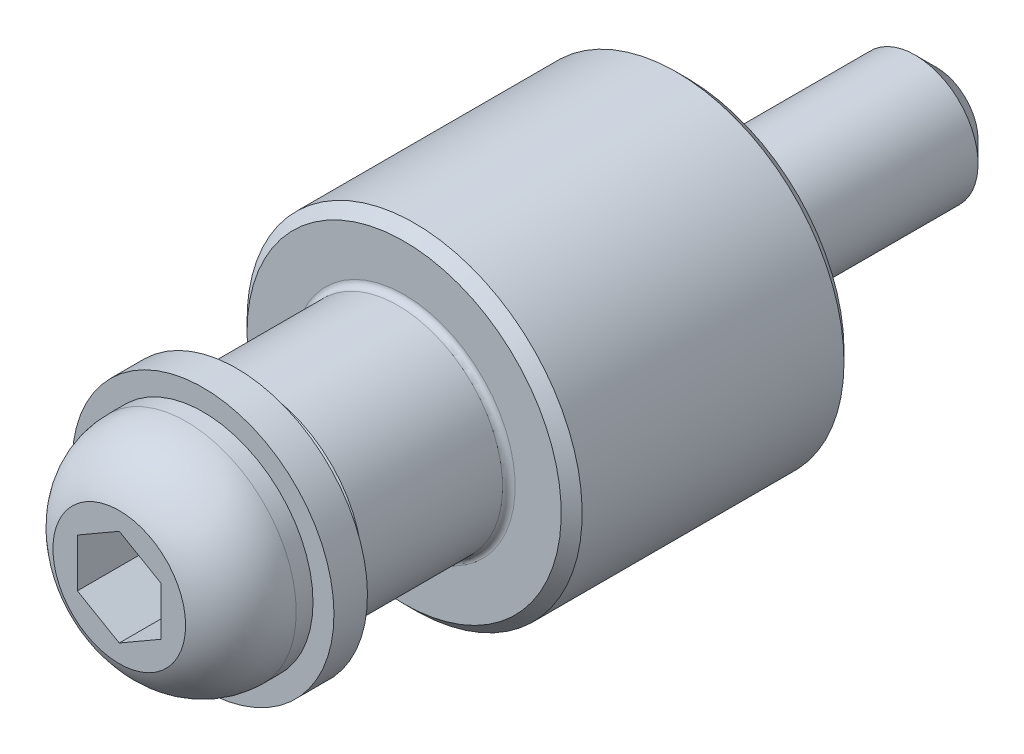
ISO-10303-21;
HEADER;
FILE_DESCRIPTION(('STEP AP214'),'2;1');
FILE_NAME('part.step','',(''),(''),'','','');
FILE_SCHEMA(('AUTOMOTIVE_DESIGN { 1 0 10303 214 1 1 1 1 }'));
ENDSEC;
DATA;
#1=APPLICATION_CONTEXT('core data for automotive mechanical design processes');
#2=APPLICATION_PROTOCOL_DEFINITION('international standard','automotive_design',2000,#1);
#3=PRODUCT_CONTEXT('',#1,'mechanical');
#4=PRODUCT('Part','Part','',(#3));
#5=PRODUCT_RELATED_PRODUCT_CATEGORY('part','',(#4));
#6=PRODUCT_DEFINITION_FORMATION('','',#4);
#7=PRODUCT_DEFINITION_CONTEXT('part definition',#1,'design');
#8=PRODUCT_DEFINITION('design','',#6,#7);
#9=PRODUCT_DEFINITION_SHAPE('','',#8);
#10=(LENGTH_UNIT() NAMED_UNIT(*) SI_UNIT(.MILLI.,.METRE.));
#11=(NAMED_UNIT(*) PLANE_ANGLE_UNIT() SI_UNIT($,.RADIAN.));
#12=(NAMED_UNIT(*) SI_UNIT($,.STERADIAN.) SOLID_ANGLE_UNIT());
#13=UNCERTAINTY_MEASURE_WITH_UNIT(LENGTH_MEASURE(1.E-05),#10,'distance_accuracy_value','');
#14=(GEOMETRIC_REPRESENTATION_CONTEXT(3) GLOBAL_UNCERTAINTY_ASSIGNED_CONTEXT((#13)) GLOBAL_UNIT_ASSIGNED_CONTEXT((#10,
#11,#12)) REPRESENTATION_CONTEXT('',''));
#15=CARTESIAN_POINT('',(0.,0.,0.));
#16=DIRECTION('',(0.,0.,1.));
#17=DIRECTION('',(1.,0.,0.));
#18=AXIS2_PLACEMENT_3D('',#15,#16,#17);
#19=CARTESIAN_POINT('',(2.,-1.15470053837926,24.1));
#20=DIRECTION('',(0.,0.,1.));
#21=DIRECTION('',(-0.5,-0.866025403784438,0.));
#22=AXIS2_PLACEMENT_3D('',#19,#20,#21);
#23=PLANE('',#22);
#24=DIRECTION('',(0.86602540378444,0.5,0.));
#25=VECTOR('',#24,1.);
#26=CARTESIAN_POINT('',(0.,-2.30940107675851,24.1));
#27=LINE('',#26,#25);
#28=CARTESIAN_POINT('',(0.,-2.30940107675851,24.1));
#29=VERTEX_POINT('',#28);
#30=CARTESIAN_POINT('',(2.,-1.15470053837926,24.1));
#31=VERTEX_POINT('',#30);
#32=EDGE_CURVE('E101',#29,#31,#27,.T.);
#33=ORIENTED_EDGE('',*,*,#32,.T.);
#34=DIRECTION('',(0.,1.,0.));
#35=VECTOR('',#34,1.);
#36=CARTESIAN_POINT('',(2.,-1.15470053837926,24.1));
#37=LINE('',#36,#35);
#38=CARTESIAN_POINT('',(2.,1.15470053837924,24.1));
#39=VERTEX_POINT('',#38);
#40=EDGE_CURVE('E104',#31,#39,#37,.T.);
#41=ORIENTED_EDGE('',*,*,#40,.T.);
#42=DIRECTION('',(-0.866025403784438,0.5,0.));
#43=VECTOR('',#42,1.);
#44=CARTESIAN_POINT('',(2.,1.15470053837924,24.1));
#45=LINE('',#44,#43);
#46=CARTESIAN_POINT('',(0.,2.30940107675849,24.1));
#47=VERTEX_POINT('',#46);
#48=EDGE_CURVE('E75',#39,#47,#45,.T.);
#49=ORIENTED_EDGE('',*,*,#48,.T.);
#50=DIRECTION('',(-0.86602540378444,-0.5,0.));
#51=VECTOR('',#50,1.);
#52=CARTESIAN_POINT('',(0.,2.30940107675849,24.1));
#53=LINE('',#52,#51);
#54=CARTESIAN_POINT('',(-2.,1.15470053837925,24.1));
#55=VERTEX_POINT('',#54);
#56=EDGE_CURVE('E107',#47,#55,#53,.T.);
#57=ORIENTED_EDGE('',*,*,#56,.T.);
#58=DIRECTION('',(0.,-1.,0.));
#59=VECTOR('',#58,1.);
#60=CARTESIAN_POINT('',(-2.,1.15470053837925,24.1));
#61=LINE('',#60,#59);
#62=CARTESIAN_POINT('',(-2.,-1.15470053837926,24.1));
#63=VERTEX_POINT('',#62);
#64=EDGE_CURVE('E110',#55,#63,#61,.T.);
#65=ORIENTED_EDGE('',*,*,#64,.T.);
#66=DIRECTION('',(0.866025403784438,-0.5,0.));
#67=VECTOR('',#66,1.);
#68=CARTESIAN_POINT('',(-2.,-1.15470053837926,24.1));
#69=LINE('',#68,#67);
#70=EDGE_CURVE('E113',#63,#29,#69,.T.);
#71=ORIENTED_EDGE('',*,*,#70,.T.);
#72=EDGE_LOOP('',(#33,#41,#49,#57,#65,#71));
#73=FACE_BOUND('',#72,.T.);
#74=ADVANCED_FACE('F14',(#73),#23,.T.);
#75=CARTESIAN_POINT('',(2.,1.15470053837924,24.1));
#76=DIRECTION('',(0.5,0.866025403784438,0.));
#77=DIRECTION('',(-0.866025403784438,0.5,0.));
#78=AXIS2_PLACEMENT_3D('',#75,#76,#77);
#79=PLANE('',#78);
#80=DIRECTION('',(-0.866025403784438,0.5,0.));
#81=VECTOR('',#80,1.);
#82=CARTESIAN_POINT('',(2.,1.15470053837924,27.1));
#83=LINE('',#82,#81);
#84=CARTESIAN_POINT('',(2.,1.15470053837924,27.1));
#85=VERTEX_POINT('',#84);
#86=CARTESIAN_POINT('',(0.,2.30940107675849,27.1));
#87=VERTEX_POINT('',#86);
#88=EDGE_CURVE('E72',#85,#87,#83,.T.);
#89=ORIENTED_EDGE('',*,*,#88,.T.);
#90=DIRECTION('',(0.,0.,1.));
#91=VECTOR('',#90,1.);
#92=CARTESIAN_POINT('',(0.,2.30940107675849,24.1));
#93=LINE('',#92,#91);
#94=EDGE_CURVE('E79',#47,#87,#93,.T.);
#95=ORIENTED_EDGE('',*,*,#94,.F.);
#96=ORIENTED_EDGE('',*,*,#48,.F.);
#97=DIRECTION('',(0.,0.,1.));
#98=VECTOR('',#97,1.);
#99=CARTESIAN_POINT('',(2.,1.15470053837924,24.1));
#100=LINE('',#99,#98);
#101=EDGE_CURVE('E68',#39,#85,#100,.T.);
#102=ORIENTED_EDGE('',*,*,#101,.T.);
#103=EDGE_LOOP('',(#89,#95,#96,#102));
#104=FACE_BOUND('',#103,.T.);
#105=ADVANCED_FACE('F70',(#104),#79,.F.);
#106=CARTESIAN_POINT('',(0.,2.30940107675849,24.1));
#107=DIRECTION('',(-0.5,0.86602540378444,0.));
#108=DIRECTION('',(-0.86602540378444,-0.5,0.));
#109=AXIS2_PLACEMENT_3D('',#106,#107,#108);
#110=PLANE('',#109);
#111=DIRECTION('',(-0.86602540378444,-0.5,0.));
#112=VECTOR('',#111,1.);
#113=CARTESIAN_POINT('',(0.,2.30940107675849,27.1));
#114=LINE('',#113,#112);
#115=CARTESIAN_POINT('',(-2.,1.15470053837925,27.1));
#116=VERTEX_POINT('',#115);
#117=EDGE_CURVE('E91',#87,#116,#114,.T.);
#118=ORIENTED_EDGE('',*,*,#117,.T.);
#119=DIRECTION('',(0.,0.,1.));
#120=VECTOR('',#119,1.);
#121=CARTESIAN_POINT('',(-2.,1.15470053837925,24.1));
#122=LINE('',#121,#120);
#123=EDGE_CURVE('E120',#55,#116,#122,.T.);
#124=ORIENTED_EDGE('',*,*,#123,.F.);
#125=ORIENTED_EDGE('',*,*,#56,.F.);
#126=ORIENTED_EDGE('',*,*,#94,.T.);
#127=EDGE_LOOP('',(#118,#124,#125,#126));
#128=FACE_BOUND('',#127,.T.);
#129=ADVANCED_FACE('F293',(#128),#110,.F.);
#130=CARTESIAN_POINT('',(-2.,1.15470053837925,24.1));
#131=DIRECTION('',(-1.,0.,0.));
#132=DIRECTION('',(0.,-1.,0.));
#133=AXIS2_PLACEMENT_3D('',#130,#131,#132);
#134=PLANE('',#133);
#135=DIRECTION('',(0.,-1.,0.));
#136=VECTOR('',#135,1.);
#137=CARTESIAN_POINT('',(-2.,1.15470053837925,27.1));
#138=LINE('',#137,#136);
#139=CARTESIAN_POINT('',(-2.,-1.15470053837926,27.1));
#140=VERTEX_POINT('',#139);
#141=EDGE_CURVE('E93',#116,#140,#138,.T.);
#142=ORIENTED_EDGE('',*,*,#141,.T.);
#143=DIRECTION('',(0.,0.,1.));
#144=VECTOR('',#143,1.);
#145=CARTESIAN_POINT('',(-2.,-1.15470053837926,24.1));
#146=LINE('',#145,#144);
#147=EDGE_CURVE('E118',#63,#140,#146,.T.);
#148=ORIENTED_EDGE('',*,*,#147,.F.);
#149=ORIENTED_EDGE('',*,*,#64,.F.);
#150=ORIENTED_EDGE('',*,*,#123,.T.);
#151=EDGE_LOOP('',(#142,#148,#149,#150));
#152=FACE_BOUND('',#151,.T.);
#153=ADVANCED_FACE('F290',(#152),#134,.F.);
#154=CARTESIAN_POINT('',(-2.,-1.15470053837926,24.1));
#155=DIRECTION('',(-0.5,-0.866025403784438,0.));
#156=DIRECTION('',(0.866025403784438,-0.5,0.));
#157=AXIS2_PLACEMENT_3D('',#154,#155,#156);
#158=PLANE('',#157);
#159=DIRECTION('',(0.866025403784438,-0.5,0.));
#160=VECTOR('',#159,1.);
#161=CARTESIAN_POINT('',(-2.,-1.15470053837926,27.1));
#162=LINE('',#161,#160);
#163=CARTESIAN_POINT('',(0.,-2.30940107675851,27.1));
#164=VERTEX_POINT('',#163);
#165=EDGE_CURVE('E99',#140,#164,#162,.T.);
#166=ORIENTED_EDGE('',*,*,#165,.T.);
#167=DIRECTION('',(0.,0.,1.));
#168=VECTOR('',#167,1.);
#169=CARTESIAN_POINT('',(0.,-2.30940107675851,24.1));
#170=LINE('',#169,#168);
#171=EDGE_CURVE('E36',#29,#164,#170,.T.);
#172=ORIENTED_EDGE('',*,*,#171,.F.);
#173=ORIENTED_EDGE('',*,*,#70,.F.);
#174=ORIENTED_EDGE('',*,*,#147,.T.);
#175=EDGE_LOOP('',(#166,#172,#173,#174));
#176=FACE_BOUND('',#175,.T.);
#177=ADVANCED_FACE('F286',(#176),#158,.F.);
#178=CARTESIAN_POINT('',(0.,-2.30940107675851,24.1));
#179=DIRECTION('',(0.5,-0.86602540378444,0.));
#180=DIRECTION('',(0.86602540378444,0.5,0.));
#181=AXIS2_PLACEMENT_3D('',#178,#179,#180);
#182=PLANE('',#181);
#183=DIRECTION('',(0.86602540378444,0.5,0.));
#184=VECTOR('',#183,1.);
#185=CARTESIAN_POINT('',(0.,-2.30940107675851,27.1));
#186=LINE('',#185,#184);
#187=CARTESIAN_POINT('',(2.,-1.15470053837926,27.1));
#188=VERTEX_POINT('',#187);
#189=EDGE_CURVE('E29',#164,#188,#186,.T.);
#190=ORIENTED_EDGE('',*,*,#189,.T.);
#191=DIRECTION('',(0.,0.,1.));
#192=VECTOR('',#191,1.);
#193=CARTESIAN_POINT('',(2.,-1.15470053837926,24.1));
#194=LINE('',#193,#192);
#195=EDGE_CURVE('E80',#31,#188,#194,.T.);
#196=ORIENTED_EDGE('',*,*,#195,.F.);
#197=ORIENTED_EDGE('',*,*,#32,.F.);
#198=ORIENTED_EDGE('',*,*,#171,.T.);
#199=EDGE_LOOP('',(#190,#196,#197,#198));
#200=FACE_BOUND('',#199,.T.);
#201=ADVANCED_FACE('F289',(#200),#182,.F.);
#202=CARTESIAN_POINT('',(2.,-1.15470053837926,24.1));
#203=DIRECTION('',(1.,0.,0.));
#204=DIRECTION('',(0.,1.,0.));
#205=AXIS2_PLACEMENT_3D('',#202,#203,#204);
#206=PLANE('',#205);
#207=DIRECTION('',(0.,1.,0.));
#208=VECTOR('',#207,1.);
#209=CARTESIAN_POINT('',(2.,-1.15470053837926,27.1));
#210=LINE('',#209,#208);
#211=EDGE_CURVE('E83',#188,#85,#210,.T.);
#212=ORIENTED_EDGE('',*,*,#211,.T.);
#213=ORIENTED_EDGE('',*,*,#101,.F.);
#214=ORIENTED_EDGE('',*,*,#40,.F.);
#215=ORIENTED_EDGE('',*,*,#195,.T.);
#216=EDGE_LOOP('',(#212,#213,#214,#215));
#217=FACE_BOUND('',#216,.T.);
#218=ADVANCED_FACE('F84',(#217),#206,.F.);
#219=CARTESIAN_POINT('',(0.,0.,27.1));
#220=DIRECTION('',(0.,0.,-1.));
#221=DIRECTION('',(0.5,0.866025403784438,0.));
#222=AXIS2_PLACEMENT_3D('',#219,#220,#221);
#223=PLANE('',#222);
#224=ORIENTED_EDGE('',*,*,#211,.F.);
#225=ORIENTED_EDGE('',*,*,#189,.F.);
#226=ORIENTED_EDGE('',*,*,#165,.F.);
#227=ORIENTED_EDGE('',*,*,#141,.F.);
#228=ORIENTED_EDGE('',*,*,#117,.F.);
#229=ORIENTED_EDGE('',*,*,#88,.F.);
#230=EDGE_LOOP('',(#224,#225,#226,#227,#228,#229));
#231=FACE_BOUND('',#230,.T.);
#232=CARTESIAN_POINT('',(0.,0.,27.1));
#233=DIRECTION('',(0.,0.,1.));
#234=DIRECTION('',(-0.5,-0.866025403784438,0.));
#235=AXIS2_PLACEMENT_3D('',#232,#233,#234);
#236=CIRCLE('',#235,3.16774468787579);
#237=CARTESIAN_POINT('',(-1.58387234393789,-2.74334737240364,27.1));
#238=VERTEX_POINT('',#237);
#239=EDGE_CURVE('E126',#238,#238,#236,.T.);
#240=ORIENTED_EDGE('',*,*,#239,.T.);
#241=EDGE_LOOP('',(#240));
#242=FACE_BOUND('',#241,.T.);
#243=ADVANCED_FACE('F87',(#231,#242),#223,.F.);
#244=CARTESIAN_POINT('',(0.,0.,23.9));
#245=DIRECTION('',(0.,0.,1.));
#246=DIRECTION('',(-0.5,-0.866025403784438,0.));
#247=AXIS2_PLACEMENT_3D('',#244,#245,#246);
#248=DEGENERATE_TOROIDAL_SURFACE('',#247,1.75,3.5,.T.);
#249=ORIENTED_EDGE('',*,*,#239,.F.);
#250=EDGE_LOOP('',(#249));
#251=FACE_BOUND('',#250,.T.);
#252=CARTESIAN_POINT('',(0.,0.,23.9));
#253=DIRECTION('',(0.,0.,1.));
#254=DIRECTION('',(-0.5,-0.866025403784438,0.));
#255=AXIS2_PLACEMENT_3D('',#252,#253,#254);
#256=CIRCLE('',#255,5.25);
#257=CARTESIAN_POINT('',(-2.625,-4.5466333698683,23.9));
#258=VERTEX_POINT('',#257);
#259=EDGE_CURVE('E129',#258,#258,#256,.T.);
#260=ORIENTED_EDGE('',*,*,#259,.T.);
#261=EDGE_LOOP('',(#260));
#262=FACE_BOUND('',#261,.T.);
#263=ADVANCED_FACE('F169',(#251,#262),#248,.T.);
#264=CARTESIAN_POINT('',(0.,0.,27.1));
#265=DIRECTION('',(0.,0.,1.));
#266=DIRECTION('',(-0.5,-0.866025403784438,0.));
#267=AXIS2_PLACEMENT_3D('',#264,#265,#266);
#268=CYLINDRICAL_SURFACE('',#267,5.25);
#269=ORIENTED_EDGE('',*,*,#259,.F.);
#270=EDGE_LOOP('',(#269));
#271=FACE_BOUND('',#270,.T.);
#272=CARTESIAN_POINT('',(0.,0.,23.1));
#273=DIRECTION('',(0.,0.,1.));
#274=DIRECTION('',(-0.5,-0.866025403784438,0.));
#275=AXIS2_PLACEMENT_3D('',#272,#273,#274);
#276=CIRCLE('',#275,5.25);
#277=CARTESIAN_POINT('',(-2.625,-4.5466333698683,23.1));
#278=VERTEX_POINT('',#277);
#279=EDGE_CURVE('E132',#278,#278,#276,.T.);
#280=ORIENTED_EDGE('',*,*,#279,.T.);
#281=EDGE_LOOP('',(#280));
#282=FACE_BOUND('',#281,.T.);
#283=ADVANCED_FACE('F158',(#271,#282),#268,.T.);
#284=CARTESIAN_POINT('',(0.,0.,27.1));
#285=DIRECTION('',(0.,0.,1.));
#286=DIRECTION('',(-0.5,-0.866025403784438,0.));
#287=AXIS2_PLACEMENT_3D('',#284,#285,#286);
#288=CYLINDRICAL_SURFACE('',#287,3.);
#289=CARTESIAN_POINT('',(0.,0.,-10.9));
#290=DIRECTION('',(0.,0.,-1.));
#291=DIRECTION('',(0.,1.,0.));
#292=AXIS2_PLACEMENT_3D('',#289,#290,#291);
#293=CIRCLE('',#292,3.);
#294=CARTESIAN_POINT('',(0.,2.99999999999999,-10.9));
#295=VERTEX_POINT('',#294);
#296=EDGE_CURVE('E9',#295,#295,#293,.F.);
#297=ORIENTED_EDGE('',*,*,#296,.T.);
#298=EDGE_LOOP('',(#297));
#299=FACE_BOUND('',#298,.T.);
#300=CARTESIAN_POINT('',(0.,0.,0.));
#301=DIRECTION('',(0.,0.,-1.));
#302=DIRECTION('',(-0.866025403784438,0.5,0.));
#303=AXIS2_PLACEMENT_3D('',#300,#301,#302);
#304=CIRCLE('',#303,3.);
#305=CARTESIAN_POINT('',(-2.59807621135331,1.5,0.));
#306=VERTEX_POINT('',#305);
#307=EDGE_CURVE('E135',#306,#306,#304,.T.);
#308=ORIENTED_EDGE('',*,*,#307,.T.);
#309=EDGE_LOOP('',(#308));
#310=FACE_BOUND('',#309,.T.);
#311=ADVANCED_FACE('F155',(#299,#310),#288,.T.);
#312=CARTESIAN_POINT('',(0.,0.,23.1));
#313=DIRECTION('',(0.,0.,1.));
#314=DIRECTION('',(-0.5,-0.866025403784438,0.));
#315=AXIS2_PLACEMENT_3D('',#312,#313,#314);
#316=CIRCLE('',#315,3.);
#317=CARTESIAN_POINT('',(-1.5,-2.59807621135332,23.1));
#318=VERTEX_POINT('',#317);
#319=EDGE_CURVE('E117',#318,#318,#316,.T.);
#320=ORIENTED_EDGE('',*,*,#319,.F.);
#321=EDGE_LOOP('',(#320));
#322=FACE_BOUND('',#321,.T.);
#323=CARTESIAN_POINT('',(0.,0.,21.));
#324=DIRECTION('',(0.,0.,-1.));
#325=DIRECTION('',(-0.866025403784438,0.5,0.));
#326=AXIS2_PLACEMENT_3D('',#323,#324,#325);
#327=CIRCLE('',#326,3.);
#328=CARTESIAN_POINT('',(-2.59807621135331,1.5,21.));
#329=VERTEX_POINT('',#328);
#330=EDGE_CURVE('E138',#329,#329,#327,.T.);
#331=ORIENTED_EDGE('',*,*,#330,.F.);
#332=EDGE_LOOP('',(#331));
#333=FACE_BOUND('',#332,.T.);
#334=ADVANCED_FACE('F157',(#322,#333),#288,.T.);
#335=CARTESIAN_POINT('',(1.5,2.59807621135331,23.1));
#336=DIRECTION('',(0.,0.,1.));
#337=DIRECTION('',(-0.5,-0.866025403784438,0.));
#338=AXIS2_PLACEMENT_3D('',#335,#336,#337);
#339=PLANE('',#338);
#340=CARTESIAN_POINT('',(0.,0.,23.1));
#341=DIRECTION('',(0.,0.,1.));
#342=DIRECTION('',(0.5,0.866025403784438,0.));
#343=AXIS2_PLACEMENT_3D('',#340,#341,#342);
#344=CIRCLE('',#343,3.2);
#345=CARTESIAN_POINT('',(1.6,2.7712812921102,23.1));
#346=VERTEX_POINT('',#345);
#347=EDGE_CURVE('E136',#346,#346,#344,.F.);
#348=ORIENTED_EDGE('',*,*,#347,.T.);
#349=EDGE_LOOP('',(#348));
#350=FACE_BOUND('',#349,.T.);
#351=ORIENTED_EDGE('',*,*,#319,.T.);
#352=EDGE_LOOP('',(#351));
#353=FACE_BOUND('',#352,.T.);
#354=ADVANCED_FACE('F166',(#350,#353),#339,.F.);
#355=CARTESIAN_POINT('',(0.,0.,23.1));
#356=DIRECTION('',(0.,0.,-1.));
#357=DIRECTION('',(-0.866025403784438,0.5,0.));
#358=AXIS2_PLACEMENT_3D('',#355,#356,#357);
#359=CYLINDRICAL_SURFACE('',#358,6.25);
#360=CARTESIAN_POINT('',(0.,0.,23.1));
#361=DIRECTION('',(0.,0.,1.));
#362=DIRECTION('',(0.866025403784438,-0.5,0.));
#363=AXIS2_PLACEMENT_3D('',#360,#361,#362);
#364=CIRCLE('',#363,6.25);
#365=CARTESIAN_POINT('',(5.41265877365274,-3.125,23.1));
#366=VERTEX_POINT('',#365);
#367=EDGE_CURVE('E256',#366,#366,#364,.T.);
#368=ORIENTED_EDGE('',*,*,#367,.F.);
#369=EDGE_LOOP('',(#368));
#370=FACE_BOUND('',#369,.T.);
#371=CARTESIAN_POINT('',(0.,0.,21.5));
#372=DIRECTION('',(0.,0.,1.));
#373=DIRECTION('',(0.866025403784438,-0.5,0.));
#374=AXIS2_PLACEMENT_3D('',#371,#372,#373);
#375=CIRCLE('',#374,6.25);
#376=CARTESIAN_POINT('',(5.41265877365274,-3.125,21.5));
#377=VERTEX_POINT('',#376);
#378=EDGE_CURVE('E253',#377,#377,#375,.T.);
#379=ORIENTED_EDGE('',*,*,#378,.T.);
#380=EDGE_LOOP('',(#379));
#381=FACE_BOUND('',#380,.T.);
#382=ADVANCED_FACE('F262',(#370,#381),#359,.T.);
#383=CARTESIAN_POINT('',(0.,0.,23.1));
#384=DIRECTION('',(0.,0.,1.));
#385=DIRECTION('',(0.866025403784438,-0.5,0.));
#386=AXIS2_PLACEMENT_3D('',#383,#384,#385);
#387=PLANE('',#386);
#388=ORIENTED_EDGE('',*,*,#367,.T.);
#389=EDGE_LOOP('',(#388));
#390=FACE_BOUND('',#389,.T.);
#391=ORIENTED_EDGE('',*,*,#279,.F.);
#392=EDGE_LOOP('',(#391));
#393=FACE_BOUND('',#392,.T.);
#394=ADVANCED_FACE('F172',(#390,#393),#387,.T.);
#395=CARTESIAN_POINT('',(0.,0.,21.5));
#396=DIRECTION('',(0.,0.,1.));
#397=DIRECTION('',(0.866025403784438,-0.5,0.));
#398=AXIS2_PLACEMENT_3D('',#395,#396,#397);
#399=PLANE('',#398);
#400=ORIENTED_EDGE('',*,*,#378,.F.);
#401=EDGE_LOOP('',(#400));
#402=FACE_BOUND('',#401,.T.);
#403=CARTESIAN_POINT('',(0.,0.,21.5));
#404=DIRECTION('',(0.,0.,1.));
#405=DIRECTION('',(0.866025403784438,-0.5,0.));
#406=AXIS2_PLACEMENT_3D('',#403,#404,#405);
#407=CIRCLE('',#406,3.2);
#408=CARTESIAN_POINT('',(2.7712812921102,-1.6,21.5));
#409=VERTEX_POINT('',#408);
#410=EDGE_CURVE('E250',#409,#409,#407,.T.);
#411=ORIENTED_EDGE('',*,*,#410,.T.);
#412=EDGE_LOOP('',(#411));
#413=FACE_BOUND('',#412,.T.);
#414=ADVANCED_FACE('F266',(#402,#413),#399,.F.);
#415=CARTESIAN_POINT('',(0.,0.,23.1));
#416=DIRECTION('',(0.,0.,-1.));
#417=DIRECTION('',(-0.866025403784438,0.5,0.));
#418=AXIS2_PLACEMENT_3D('',#415,#416,#417);
#419=CYLINDRICAL_SURFACE('',#418,3.2);
#420=ORIENTED_EDGE('',*,*,#347,.F.);
#421=EDGE_LOOP('',(#420));
#422=FACE_BOUND('',#421,.T.);
#423=ORIENTED_EDGE('',*,*,#410,.F.);
#424=EDGE_LOOP('',(#423));
#425=FACE_BOUND('',#424,.T.);
#426=ADVANCED_FACE('F153',(#422,#425),#419,.F.);
#427=CARTESIAN_POINT('',(0.,0.,13.8));
#428=DIRECTION('',(0.,0.,1.));
#429=DIRECTION('',(0.866025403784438,-0.5,0.));
#430=AXIS2_PLACEMENT_3D('',#427,#428,#429);
#431=TOROIDAL_SURFACE('',#430,5.3,0.3);
#432=CARTESIAN_POINT('',(0.,0.,13.8));
#433=DIRECTION('',(0.,0.,1.));
#434=DIRECTION('',(0.866025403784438,-0.5,0.));
#435=AXIS2_PLACEMENT_3D('',#432,#433,#434);
#436=CIRCLE('',#435,5.);
#437=CARTESIAN_POINT('',(4.33012701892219,-2.5,13.8));
#438=VERTEX_POINT('',#437);
#439=EDGE_CURVE('E232',#438,#438,#436,.T.);
#440=ORIENTED_EDGE('',*,*,#439,.F.);
#441=EDGE_LOOP('',(#440));
#442=FACE_BOUND('',#441,.T.);
#443=CARTESIAN_POINT('',(0.,0.,13.5));
#444=DIRECTION('',(0.,0.,1.));
#445=DIRECTION('',(0.866025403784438,-0.5,0.));
#446=AXIS2_PLACEMENT_3D('',#443,#444,#445);
#447=CIRCLE('',#446,5.3);
#448=CARTESIAN_POINT('',(4.58993464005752,-2.65,13.5));
#449=VERTEX_POINT('',#448);
#450=EDGE_CURVE('E241',#449,#449,#447,.F.);
#451=ORIENTED_EDGE('',*,*,#450,.F.);
#452=EDGE_LOOP('',(#451));
#453=FACE_BOUND('',#452,.T.);
#454=ADVANCED_FACE('F168',(#442,#453),#431,.F.);
#455=CARTESIAN_POINT('',(0.,0.,0.));
#456=DIRECTION('',(0.,0.,-1.));
#457=DIRECTION('',(-0.866025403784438,0.5,0.));
#458=AXIS2_PLACEMENT_3D('',#455,#456,#457);
#459=CYLINDRICAL_SURFACE('',#458,5.);
#460=ORIENTED_EDGE('',*,*,#439,.T.);
#461=EDGE_LOOP('',(#460));
#462=FACE_BOUND('',#461,.T.);
#463=CARTESIAN_POINT('',(0.,0.,20.5));
#464=DIRECTION('',(0.,0.,1.));
#465=DIRECTION('',(0.866025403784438,-0.5,0.));
#466=AXIS2_PLACEMENT_3D('',#463,#464,#465);
#467=CIRCLE('',#466,5.);
#468=CARTESIAN_POINT('',(4.33012701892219,-2.5,20.5));
#469=VERTEX_POINT('',#468);
#470=EDGE_CURVE('E235',#469,#469,#467,.F.);
#471=ORIENTED_EDGE('',*,*,#470,.T.);
#472=EDGE_LOOP('',(#471));
#473=FACE_BOUND('',#472,.T.);
#474=ADVANCED_FACE('F208',(#462,#473),#459,.T.);
#475=CARTESIAN_POINT('',(0.,0.,20.5));
#476=DIRECTION('',(0.,0.,-1.));
#477=DIRECTION('',(-0.866025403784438,0.5,0.));
#478=AXIS2_PLACEMENT_3D('',#475,#476,#477);
#479=CONICAL_SURFACE('',#478,5.,0.785398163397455);
#480=CARTESIAN_POINT('',(0.,0.,21.));
#481=DIRECTION('',(0.,0.,1.));
#482=DIRECTION('',(0.866025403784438,-0.5,0.));
#483=AXIS2_PLACEMENT_3D('',#480,#481,#482);
#484=CIRCLE('',#483,4.5);
#485=CARTESIAN_POINT('',(3.89711431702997,-2.25,21.));
#486=VERTEX_POINT('',#485);
#487=EDGE_CURVE('E237',#486,#486,#484,.T.);
#488=ORIENTED_EDGE('',*,*,#487,.F.);
#489=EDGE_LOOP('',(#488));
#490=FACE_BOUND('',#489,.T.);
#491=ORIENTED_EDGE('',*,*,#470,.F.);
#492=EDGE_LOOP('',(#491));
#493=FACE_BOUND('',#492,.T.);
#494=ADVANCED_FACE('F202',(#490,#493),#479,.T.);
#495=CARTESIAN_POINT('',(2.5,4.33012701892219,21.));
#496=DIRECTION('',(0.,0.,1.));
#497=DIRECTION('',(0.866025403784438,-0.5,0.));
#498=AXIS2_PLACEMENT_3D('',#495,#496,#497);
#499=PLANE('',#498);
#500=ORIENTED_EDGE('',*,*,#487,.T.);
#501=EDGE_LOOP('',(#500));
#502=FACE_BOUND('',#501,.T.);
#503=ORIENTED_EDGE('',*,*,#330,.T.);
#504=EDGE_LOOP('',(#503));
#505=FACE_BOUND('',#504,.T.);
#506=ADVANCED_FACE('F188',(#502,#505),#499,.T.);
#507=CARTESIAN_POINT('',(4.,6.9282032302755,13.5));
#508=DIRECTION('',(0.,0.,1.));
#509=DIRECTION('',(0.866025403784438,-0.5,0.));
#510=AXIS2_PLACEMENT_3D('',#507,#508,#509);
#511=PLANE('',#510);
#512=ORIENTED_EDGE('',*,*,#450,.T.);
#513=EDGE_LOOP('',(#512));
#514=FACE_BOUND('',#513,.T.);
#515=CARTESIAN_POINT('',(0.,0.,13.5));
#516=DIRECTION('',(0.,0.,1.));
#517=DIRECTION('',(0.866025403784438,-0.5,0.));
#518=AXIS2_PLACEMENT_3D('',#515,#516,#517);
#519=CIRCLE('',#518,7.5);
#520=CARTESIAN_POINT('',(6.49519052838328,-3.75,13.5));
#521=VERTEX_POINT('',#520);
#522=EDGE_CURVE('E238',#521,#521,#519,.T.);
#523=ORIENTED_EDGE('',*,*,#522,.T.);
#524=EDGE_LOOP('',(#523));
#525=FACE_BOUND('',#524,.T.);
#526=ADVANCED_FACE('F195',(#514,#525),#511,.T.);
#527=CARTESIAN_POINT('',(0.,0.,13.));
#528=DIRECTION('',(0.,0.,-1.));
#529=DIRECTION('',(-0.866025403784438,0.5,0.));
#530=AXIS2_PLACEMENT_3D('',#527,#528,#529);
#531=CONICAL_SURFACE('',#530,8.,0.785398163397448);
#532=ORIENTED_EDGE('',*,*,#522,.F.);
#533=EDGE_LOOP('',(#532));
#534=FACE_BOUND('',#533,.T.);
#535=CARTESIAN_POINT('',(0.,0.,13.));
#536=DIRECTION('',(0.,0.,1.));
#537=DIRECTION('',(0.866025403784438,-0.5,0.));
#538=AXIS2_PLACEMENT_3D('',#535,#536,#537);
#539=CIRCLE('',#538,8.);
#540=CARTESIAN_POINT('',(6.9282032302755,-4.,13.));
#541=VERTEX_POINT('',#540);
#542=EDGE_CURVE('E474',#541,#541,#539,.F.);
#543=ORIENTED_EDGE('',*,*,#542,.F.);
#544=EDGE_LOOP('',(#543));
#545=FACE_BOUND('',#544,.T.);
#546=ADVANCED_FACE('F187',(#534,#545),#531,.T.);
#547=CARTESIAN_POINT('',(0.,0.,0.));
#548=DIRECTION('',(0.,0.,-1.));
#549=DIRECTION('',(-0.866025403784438,0.5,0.));
#550=AXIS2_PLACEMENT_3D('',#547,#548,#549);
#551=CYLINDRICAL_SURFACE('',#550,8.);
#552=CARTESIAN_POINT('',(0.,0.,0.5));
#553=DIRECTION('',(0.,0.,-1.));
#554=DIRECTION('',(-0.866025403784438,0.5,0.));
#555=AXIS2_PLACEMENT_3D('',#552,#553,#554);
#556=CIRCLE('',#555,8.);
#557=CARTESIAN_POINT('',(-6.9282032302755,4.,0.5));
#558=VERTEX_POINT('',#557);
#559=EDGE_CURVE('E244',#558,#558,#556,.F.);
#560=ORIENTED_EDGE('',*,*,#559,.T.);
#561=EDGE_LOOP('',(#560));
#562=FACE_BOUND('',#561,.T.);
#563=ORIENTED_EDGE('',*,*,#542,.T.);
#564=EDGE_LOOP('',(#563));
#565=FACE_BOUND('',#564,.T.);
#566=ADVANCED_FACE('F180',(#562,#565),#551,.T.);
#567=CARTESIAN_POINT('',(0.,0.,0.));
#568=DIRECTION('',(0.,0.,1.));
#569=DIRECTION('',(0.866025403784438,-0.5,0.));
#570=AXIS2_PLACEMENT_3D('',#567,#568,#569);
#571=CONICAL_SURFACE('',#570,7.5,0.785398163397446);
#572=ORIENTED_EDGE('',*,*,#559,.F.);
#573=EDGE_LOOP('',(#572));
#574=FACE_BOUND('',#573,.T.);
#575=CARTESIAN_POINT('',(0.,0.,0.));
#576=DIRECTION('',(0.,0.,-1.));
#577=DIRECTION('',(-0.866025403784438,0.5,0.));
#578=AXIS2_PLACEMENT_3D('',#575,#576,#577);
#579=CIRCLE('',#578,7.5);
#580=CARTESIAN_POINT('',(-6.49519052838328,3.75,0.));
#581=VERTEX_POINT('',#580);
#582=EDGE_CURVE('E472',#581,#581,#579,.T.);
#583=ORIENTED_EDGE('',*,*,#582,.F.);
#584=EDGE_LOOP('',(#583));
#585=FACE_BOUND('',#584,.T.);
#586=ADVANCED_FACE('F177',(#574,#585),#571,.T.);
#587=CARTESIAN_POINT('',(0.,0.,0.));
#588=DIRECTION('',(0.,0.,-1.));
#589=DIRECTION('',(-0.866025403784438,0.5,0.));
#590=AXIS2_PLACEMENT_3D('',#587,#588,#589);
#591=PLANE('',#590);
#592=ORIENTED_EDGE('',*,*,#582,.T.);
#593=EDGE_LOOP('',(#592));
#594=FACE_BOUND('',#593,.T.);
#595=ORIENTED_EDGE('',*,*,#307,.F.);
#596=EDGE_LOOP('',(#595));
#597=FACE_BOUND('',#596,.T.);
#598=ADVANCED_FACE('F151',(#594,#597),#591,.T.);
#599=CARTESIAN_POINT('',(0.,0.,-11.9));
#600=DIRECTION('',(0.,0.,-1.));
#601=DIRECTION('',(-1.,0.,0.));
#602=AXIS2_PLACEMENT_3D('',#599,#600,#601);
#603=PLANE('',#602);
#604=CARTESIAN_POINT('',(0.,0.,-11.9));
#605=DIRECTION('',(0.,0.,-1.));
#606=DIRECTION('',(-1.,0.,0.));
#607=AXIS2_PLACEMENT_3D('',#604,#605,#606);
#608=CIRCLE('',#607,2.);
#609=CARTESIAN_POINT('',(-2.,0.,-11.9));
#610=VERTEX_POINT('',#609);
#611=EDGE_CURVE('E22',#610,#610,#608,.T.);
#612=ORIENTED_EDGE('',*,*,#611,.T.);
#613=EDGE_LOOP('',(#612));
#614=FACE_BOUND('',#613,.T.);
#615=ADVANCED_FACE('F142',(#614),#603,.T.);
#616=CARTESIAN_POINT('',(0.,0.,-11.9));
#617=DIRECTION('',(0.,0.,1.));
#618=DIRECTION('',(0.,-1.,0.));
#619=AXIS2_PLACEMENT_3D('',#616,#617,#618);
#620=CONICAL_SURFACE('',#619,2.,0.78539816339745);
#621=ORIENTED_EDGE('',*,*,#296,.F.);
#622=EDGE_LOOP('',(#621));
#623=FACE_BOUND('',#622,.T.);
#624=ORIENTED_EDGE('',*,*,#611,.F.);
#625=EDGE_LOOP('',(#624));
#626=FACE_BOUND('',#625,.T.);
#627=ADVANCED_FACE('F16',(#623,#626),#620,.T.);
#628=CLOSED_SHELL('',(#74,#105,#129,#153,#177,#201,#218,#243,#263,#283,#311,#334,#354,#382,#394,
#414,#426,#454,#474,#494,#506,#526,#546,#566,#586,#598,#615,#627));
#629=MANIFOLD_SOLID_BREP('B1',#628);
#630=ADVANCED_BREP_SHAPE_REPRESENTATION('',(#18,#629),#14);
#631=SHAPE_DEFINITION_REPRESENTATION(#9,#630);
ENDSEC;
END-ISO-10303-21;
